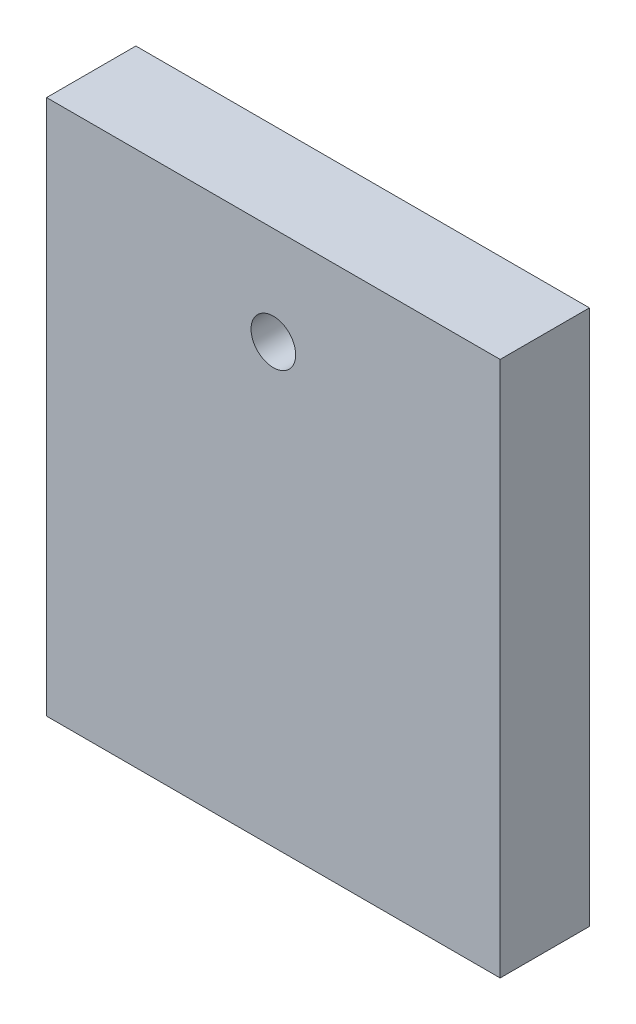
ISO-10303-21;
HEADER;
FILE_DESCRIPTION(('STEP AP214'),'2;1');
FILE_NAME('part.step','',(''),(''),'','','');
FILE_SCHEMA(('AUTOMOTIVE_DESIGN { 1 0 10303 214 1 1 1 1 }'));
ENDSEC;
DATA;
#1=APPLICATION_CONTEXT('core data for automotive mechanical design processes');
#2=APPLICATION_PROTOCOL_DEFINITION('international standard','automotive_design',2000,#1);
#3=PRODUCT_CONTEXT('',#1,'mechanical');
#4=PRODUCT('Part','Part','',(#3));
#5=PRODUCT_RELATED_PRODUCT_CATEGORY('part','',(#4));
#6=PRODUCT_DEFINITION_FORMATION('','',#4);
#7=PRODUCT_DEFINITION_CONTEXT('part definition',#1,'design');
#8=PRODUCT_DEFINITION('design','',#6,#7);
#9=PRODUCT_DEFINITION_SHAPE('','',#8);
#10=(LENGTH_UNIT() NAMED_UNIT(*) SI_UNIT(.MILLI.,.METRE.));
#11=(NAMED_UNIT(*) PLANE_ANGLE_UNIT() SI_UNIT($,.RADIAN.));
#12=(NAMED_UNIT(*) SI_UNIT($,.STERADIAN.) SOLID_ANGLE_UNIT());
#13=UNCERTAINTY_MEASURE_WITH_UNIT(LENGTH_MEASURE(1.E-05),#10,'distance_accuracy_value','');
#14=(GEOMETRIC_REPRESENTATION_CONTEXT(3) GLOBAL_UNCERTAINTY_ASSIGNED_CONTEXT((#13)) GLOBAL_UNIT_ASSIGNED_CONTEXT((#10,
#11,#12)) REPRESENTATION_CONTEXT('',''));
#15=CARTESIAN_POINT('',(0.,0.,0.));
#16=DIRECTION('',(0.,0.,1.));
#17=DIRECTION('',(1.,0.,0.));
#18=AXIS2_PLACEMENT_3D('',#15,#16,#17);
#19=CARTESIAN_POINT('',(0.,0.,10.));
#20=DIRECTION('',(0.,0.,-1.));
#21=DIRECTION('',(-1.,0.,0.));
#22=AXIS2_PLACEMENT_3D('',#19,#20,#21);
#23=PLANE('',#22);
#24=DIRECTION('',(0.,-1.,0.));
#25=VECTOR('',#24,1.);
#26=CARTESIAN_POINT('',(0.,0.,10.));
#27=LINE('',#26,#25);
#28=CARTESIAN_POINT('',(0.,60.,10.));
#29=VERTEX_POINT('',#28);
#30=CARTESIAN_POINT('',(0.,0.,10.));
#31=VERTEX_POINT('',#30);
#32=EDGE_CURVE('E87',#29,#31,#27,.T.);
#33=ORIENTED_EDGE('',*,*,#32,.T.);
#34=DIRECTION('',(1.,0.,0.));
#35=VECTOR('',#34,1.);
#36=CARTESIAN_POINT('',(0.,0.,10.));
#37=LINE('',#36,#35);
#38=CARTESIAN_POINT('',(50.8,0.,10.));
#39=VERTEX_POINT('',#38);
#40=EDGE_CURVE('E82',#31,#39,#37,.T.);
#41=ORIENTED_EDGE('',*,*,#40,.T.);
#42=DIRECTION('',(0.,1.,0.));
#43=VECTOR('',#42,1.);
#44=CARTESIAN_POINT('',(50.8,0.,10.));
#45=LINE('',#44,#43);
#46=CARTESIAN_POINT('',(50.8,60.,10.));
#47=VERTEX_POINT('',#46);
#48=EDGE_CURVE('E85',#39,#47,#45,.T.);
#49=ORIENTED_EDGE('',*,*,#48,.T.);
#50=DIRECTION('',(-1.,0.,0.));
#51=VECTOR('',#50,1.);
#52=CARTESIAN_POINT('',(0.,60.,10.));
#53=LINE('',#52,#51);
#54=EDGE_CURVE('E52',#47,#29,#53,.T.);
#55=ORIENTED_EDGE('',*,*,#54,.T.);
#56=EDGE_LOOP('',(#33,#41,#49,#55));
#57=FACE_BOUND('',#56,.T.);
#58=CARTESIAN_POINT('',(25.4,49.,10.));
#59=DIRECTION('',(0.,0.,1.));
#60=DIRECTION('',(1.,0.,0.));
#61=AXIS2_PLACEMENT_3D('',#58,#59,#60);
#62=CIRCLE('',#61,2.5);
#63=CARTESIAN_POINT('',(27.9,49.,10.));
#64=VERTEX_POINT('',#63);
#65=EDGE_CURVE('E102',#64,#64,#62,.T.);
#66=ORIENTED_EDGE('',*,*,#65,.F.);
#67=EDGE_LOOP('',(#66));
#68=FACE_BOUND('',#67,.T.);
#69=ADVANCED_FACE('F35',(#57,#68),#23,.F.);
#70=CARTESIAN_POINT('',(0.,0.,0.));
#71=DIRECTION('',(0.,0.,-1.));
#72=DIRECTION('',(-1.,0.,0.));
#73=AXIS2_PLACEMENT_3D('',#70,#71,#72);
#74=PLANE('',#73);
#75=DIRECTION('',(0.,-1.,0.));
#76=VECTOR('',#75,1.);
#77=CARTESIAN_POINT('',(0.,0.,0.));
#78=LINE('',#77,#76);
#79=CARTESIAN_POINT('',(0.,60.,0.));
#80=VERTEX_POINT('',#79);
#81=CARTESIAN_POINT('',(0.,0.,0.));
#82=VERTEX_POINT('',#81);
#83=EDGE_CURVE('E99',#80,#82,#78,.T.);
#84=ORIENTED_EDGE('',*,*,#83,.F.);
#85=DIRECTION('',(-1.,0.,0.));
#86=VECTOR('',#85,1.);
#87=CARTESIAN_POINT('',(0.,60.,0.));
#88=LINE('',#87,#86);
#89=CARTESIAN_POINT('',(50.8,60.,0.));
#90=VERTEX_POINT('',#89);
#91=EDGE_CURVE('E75',#90,#80,#88,.T.);
#92=ORIENTED_EDGE('',*,*,#91,.F.);
#93=DIRECTION('',(0.,1.,0.));
#94=VECTOR('',#93,1.);
#95=CARTESIAN_POINT('',(50.8,0.,0.));
#96=LINE('',#95,#94);
#97=CARTESIAN_POINT('',(50.8,0.,0.));
#98=VERTEX_POINT('',#97);
#99=EDGE_CURVE('E69',#98,#90,#96,.T.);
#100=ORIENTED_EDGE('',*,*,#99,.F.);
#101=DIRECTION('',(1.,0.,0.));
#102=VECTOR('',#101,1.);
#103=CARTESIAN_POINT('',(0.,0.,0.));
#104=LINE('',#103,#102);
#105=EDGE_CURVE('E91',#82,#98,#104,.T.);
#106=ORIENTED_EDGE('',*,*,#105,.F.);
#107=EDGE_LOOP('',(#84,#92,#100,#106));
#108=FACE_BOUND('',#107,.T.);
#109=CARTESIAN_POINT('',(25.4,49.,0.));
#110=DIRECTION('',(0.,0.,1.));
#111=DIRECTION('',(1.,0.,0.));
#112=AXIS2_PLACEMENT_3D('',#109,#110,#111);
#113=CIRCLE('',#112,2.5);
#114=CARTESIAN_POINT('',(27.9,49.,0.));
#115=VERTEX_POINT('',#114);
#116=EDGE_CURVE('E114',#115,#115,#113,.T.);
#117=ORIENTED_EDGE('',*,*,#116,.T.);
#118=EDGE_LOOP('',(#117));
#119=FACE_BOUND('',#118,.T.);
#120=ADVANCED_FACE('F110',(#108,#119),#74,.T.);
#121=CARTESIAN_POINT('',(0.,0.,10.));
#122=DIRECTION('',(1.,0.,0.));
#123=DIRECTION('',(0.,1.,0.));
#124=AXIS2_PLACEMENT_3D('',#121,#122,#123);
#125=PLANE('',#124);
#126=ORIENTED_EDGE('',*,*,#83,.T.);
#127=DIRECTION('',(0.,0.,-1.));
#128=VECTOR('',#127,1.);
#129=CARTESIAN_POINT('',(0.,0.,10.));
#130=LINE('',#129,#128);
#131=EDGE_CURVE('E11',#31,#82,#130,.T.);
#132=ORIENTED_EDGE('',*,*,#131,.F.);
#133=ORIENTED_EDGE('',*,*,#32,.F.);
#134=DIRECTION('',(0.,0.,-1.));
#135=VECTOR('',#134,1.);
#136=CARTESIAN_POINT('',(0.,60.,10.));
#137=LINE('',#136,#135);
#138=EDGE_CURVE('E95',#29,#80,#137,.T.);
#139=ORIENTED_EDGE('',*,*,#138,.T.);
#140=EDGE_LOOP('',(#126,#132,#133,#139));
#141=FACE_BOUND('',#140,.T.);
#142=ADVANCED_FACE('F37',(#141),#125,.F.);
#143=CARTESIAN_POINT('',(0.,0.,10.));
#144=DIRECTION('',(0.,1.,0.));
#145=DIRECTION('',(0.,0.,1.));
#146=AXIS2_PLACEMENT_3D('',#143,#144,#145);
#147=PLANE('',#146);
#148=ORIENTED_EDGE('',*,*,#105,.T.);
#149=DIRECTION('',(0.,0.,-1.));
#150=VECTOR('',#149,1.);
#151=CARTESIAN_POINT('',(50.8,0.,10.));
#152=LINE('',#151,#150);
#153=EDGE_CURVE('E44',#39,#98,#152,.T.);
#154=ORIENTED_EDGE('',*,*,#153,.F.);
#155=ORIENTED_EDGE('',*,*,#40,.F.);
#156=ORIENTED_EDGE('',*,*,#131,.T.);
#157=EDGE_LOOP('',(#148,#154,#155,#156));
#158=FACE_BOUND('',#157,.T.);
#159=ADVANCED_FACE('F90',(#158),#147,.F.);
#160=CARTESIAN_POINT('',(50.8,0.,10.));
#161=DIRECTION('',(-1.,0.,0.));
#162=DIRECTION('',(0.,-1.,0.));
#163=AXIS2_PLACEMENT_3D('',#160,#161,#162);
#164=PLANE('',#163);
#165=ORIENTED_EDGE('',*,*,#99,.T.);
#166=DIRECTION('',(0.,0.,-1.));
#167=VECTOR('',#166,1.);
#168=CARTESIAN_POINT('',(50.8,60.,10.));
#169=LINE('',#168,#167);
#170=EDGE_CURVE('E92',#47,#90,#169,.T.);
#171=ORIENTED_EDGE('',*,*,#170,.F.);
#172=ORIENTED_EDGE('',*,*,#48,.F.);
#173=ORIENTED_EDGE('',*,*,#153,.T.);
#174=EDGE_LOOP('',(#165,#171,#172,#173));
#175=FACE_BOUND('',#174,.T.);
#176=ADVANCED_FACE('F93',(#175),#164,.F.);
#177=CARTESIAN_POINT('',(0.,60.,10.));
#178=DIRECTION('',(0.,-1.,0.));
#179=DIRECTION('',(0.,0.,-1.));
#180=AXIS2_PLACEMENT_3D('',#177,#178,#179);
#181=PLANE('',#180);
#182=ORIENTED_EDGE('',*,*,#91,.T.);
#183=ORIENTED_EDGE('',*,*,#138,.F.);
#184=ORIENTED_EDGE('',*,*,#54,.F.);
#185=ORIENTED_EDGE('',*,*,#170,.T.);
#186=EDGE_LOOP('',(#182,#183,#184,#185));
#187=FACE_BOUND('',#186,.T.);
#188=ADVANCED_FACE('F107',(#187),#181,.F.);
#189=CARTESIAN_POINT('',(25.4,49.,10.));
#190=DIRECTION('',(0.,0.,-1.));
#191=DIRECTION('',(-1.,0.,0.));
#192=AXIS2_PLACEMENT_3D('',#189,#190,#191);
#193=CYLINDRICAL_SURFACE('',#192,2.5);
#194=ORIENTED_EDGE('',*,*,#65,.T.);
#195=EDGE_LOOP('',(#194));
#196=FACE_BOUND('',#195,.T.);
#197=ORIENTED_EDGE('',*,*,#116,.F.);
#198=EDGE_LOOP('',(#197));
#199=FACE_BOUND('',#198,.T.);
#200=ADVANCED_FACE('F120',(#196,#199),#193,.F.);
#201=CLOSED_SHELL('',(#69,#120,#142,#159,#176,#188,#200));
#202=MANIFOLD_SOLID_BREP('B2',#201);
#203=ADVANCED_BREP_SHAPE_REPRESENTATION('',(#18,#202),#14);
#204=SHAPE_DEFINITION_REPRESENTATION(#9,#203);
ENDSEC;
END-ISO-10303-21;
